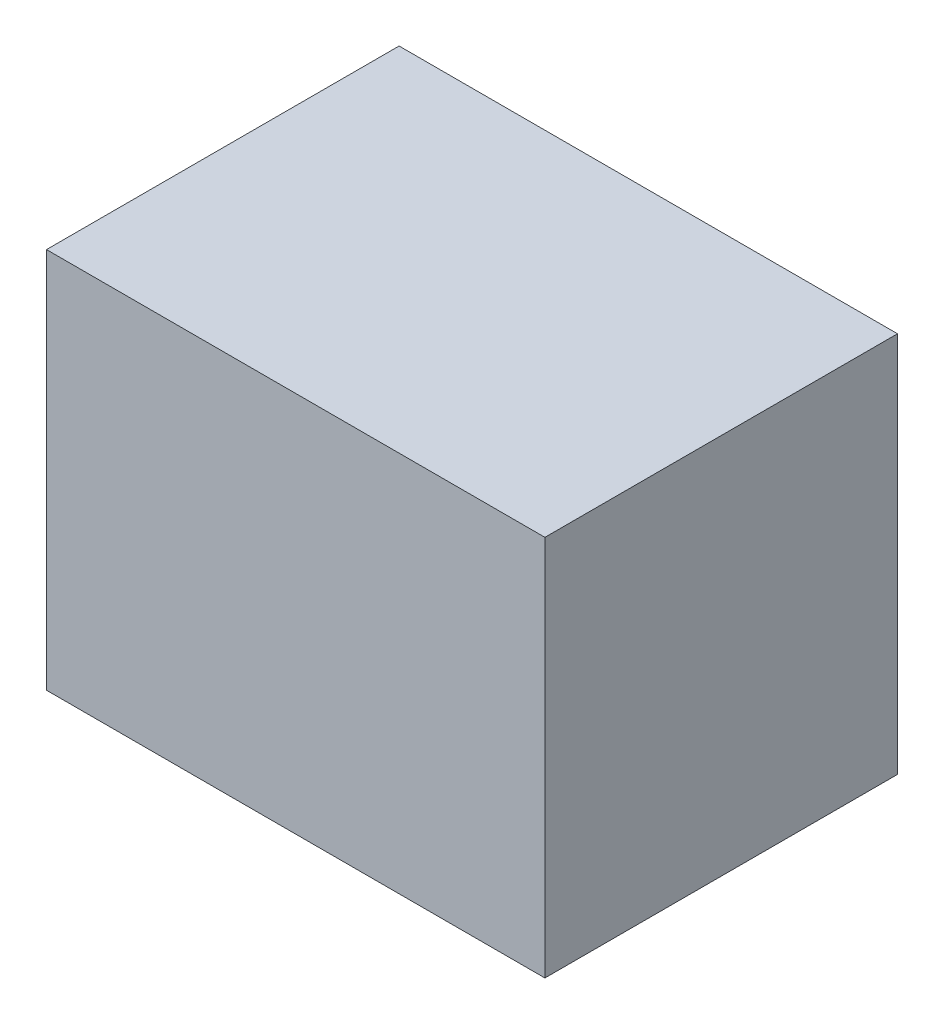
ISO-10303-21;
HEADER;
FILE_DESCRIPTION(('STEP AP214'),'2;1');
FILE_NAME('part.step','',(''),(''),'','','');
FILE_SCHEMA(('AUTOMOTIVE_DESIGN { 1 0 10303 214 1 1 1 1 }'));
ENDSEC;
DATA;
#1=APPLICATION_CONTEXT('core data for automotive mechanical design processes');
#2=APPLICATION_PROTOCOL_DEFINITION('international standard','automotive_design',2000,#1);
#3=PRODUCT_CONTEXT('',#1,'mechanical');
#4=PRODUCT('Part','Part','',(#3));
#5=PRODUCT_RELATED_PRODUCT_CATEGORY('part','',(#4));
#6=PRODUCT_DEFINITION_FORMATION('','',#4);
#7=PRODUCT_DEFINITION_CONTEXT('part definition',#1,'design');
#8=PRODUCT_DEFINITION('design','',#6,#7);
#9=PRODUCT_DEFINITION_SHAPE('','',#8);
#10=(LENGTH_UNIT() NAMED_UNIT(*) SI_UNIT(.MILLI.,.METRE.));
#11=(NAMED_UNIT(*) PLANE_ANGLE_UNIT() SI_UNIT($,.RADIAN.));
#12=(NAMED_UNIT(*) SI_UNIT($,.STERADIAN.) SOLID_ANGLE_UNIT());
#13=UNCERTAINTY_MEASURE_WITH_UNIT(LENGTH_MEASURE(1.E-05),#10,'distance_accuracy_value','');
#14=(GEOMETRIC_REPRESENTATION_CONTEXT(3) GLOBAL_UNCERTAINTY_ASSIGNED_CONTEXT((#13)) GLOBAL_UNIT_ASSIGNED_CONTEXT((#10,
#11,#12)) REPRESENTATION_CONTEXT('',''));
#15=CARTESIAN_POINT('',(0.,0.,0.));
#16=DIRECTION('',(0.,0.,1.));
#17=DIRECTION('',(1.,0.,0.));
#18=AXIS2_PLACEMENT_3D('',#15,#16,#17);
#19=CARTESIAN_POINT('',(83.0943125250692,127.254,-58.7846534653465));
#20=DIRECTION('',(-1.,0.,0.));
#21=DIRECTION('',(0.,0.,1.));
#22=AXIS2_PLACEMENT_3D('',#19,#20,#21);
#23=PLANE('',#22);
#24=DIRECTION('',(0.,0.,-1.));
#25=VECTOR('',#24,1.);
#26=CARTESIAN_POINT('',(83.0943125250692,0.,-58.7846534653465));
#27=LINE('',#26,#25);
#28=CARTESIAN_POINT('',(83.0943125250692,0.,58.7846534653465));
#29=VERTEX_POINT('',#28);
#30=CARTESIAN_POINT('',(83.0943125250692,0.,-58.7846534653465));
#31=VERTEX_POINT('',#30);
#32=EDGE_CURVE('E142',#29,#31,#27,.T.);
#33=ORIENTED_EDGE('',*,*,#32,.T.);
#34=DIRECTION('',(0.,-1.,0.));
#35=VECTOR('',#34,1.);
#36=CARTESIAN_POINT('',(83.0943125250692,127.254,-58.7846534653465));
#37=LINE('',#36,#35);
#38=CARTESIAN_POINT('',(83.0943125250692,127.254,-58.7846534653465));
#39=VERTEX_POINT('',#38);
#40=EDGE_CURVE('E133',#39,#31,#37,.T.);
#41=ORIENTED_EDGE('',*,*,#40,.F.);
#42=DIRECTION('',(0.,0.,-1.));
#43=VECTOR('',#42,1.);
#44=CARTESIAN_POINT('',(83.0943125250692,127.254,-58.7846534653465));
#45=LINE('',#44,#43);
#46=CARTESIAN_POINT('',(83.0943125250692,127.254,58.7846534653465));
#47=VERTEX_POINT('',#46);
#48=EDGE_CURVE('E127',#47,#39,#45,.T.);
#49=ORIENTED_EDGE('',*,*,#48,.F.);
#50=DIRECTION('',(0.,-1.,0.));
#51=VECTOR('',#50,1.);
#52=CARTESIAN_POINT('',(83.0943125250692,127.254,58.7846534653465));
#53=LINE('',#52,#51);
#54=EDGE_CURVE('E138',#47,#29,#53,.T.);
#55=ORIENTED_EDGE('',*,*,#54,.T.);
#56=EDGE_LOOP('',(#33,#41,#49,#55));
#57=FACE_BOUND('',#56,.T.);
#58=ADVANCED_FACE('F36',(#57),#23,.F.);
#59=CARTESIAN_POINT('',(-83.0943125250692,127.254,-58.7846534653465));
#60=DIRECTION('',(0.,0.,1.));
#61=DIRECTION('',(1.,0.,0.));
#62=AXIS2_PLACEMENT_3D('',#59,#60,#61);
#63=PLANE('',#62);
#64=DIRECTION('',(-1.,0.,0.));
#65=VECTOR('',#64,1.);
#66=CARTESIAN_POINT('',(-83.0943125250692,0.,-58.7846534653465));
#67=LINE('',#66,#65);
#68=CARTESIAN_POINT('',(-83.0943125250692,0.,-58.7846534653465));
#69=VERTEX_POINT('',#68);
#70=EDGE_CURVE('E132',#31,#69,#67,.T.);
#71=ORIENTED_EDGE('',*,*,#70,.T.);
#72=DIRECTION('',(0.,-1.,0.));
#73=VECTOR('',#72,1.);
#74=CARTESIAN_POINT('',(-83.0943125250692,127.254,-58.7846534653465));
#75=LINE('',#74,#73);
#76=CARTESIAN_POINT('',(-83.0943125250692,127.254,-58.7846534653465));
#77=VERTEX_POINT('',#76);
#78=EDGE_CURVE('E130',#77,#69,#75,.T.);
#79=ORIENTED_EDGE('',*,*,#78,.F.);
#80=DIRECTION('',(-1.,0.,0.));
#81=VECTOR('',#80,1.);
#82=CARTESIAN_POINT('',(-83.0943125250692,127.254,-58.7846534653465));
#83=LINE('',#82,#81);
#84=EDGE_CURVE('E122',#39,#77,#83,.T.);
#85=ORIENTED_EDGE('',*,*,#84,.F.);
#86=ORIENTED_EDGE('',*,*,#40,.T.);
#87=EDGE_LOOP('',(#71,#79,#85,#86));
#88=FACE_BOUND('',#87,.T.);
#89=ADVANCED_FACE('F131',(#88),#63,.F.);
#90=CARTESIAN_POINT('',(-83.0943125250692,127.254,-58.7846534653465));
#91=DIRECTION('',(1.,0.,0.));
#92=DIRECTION('',(0.,0.,-1.));
#93=AXIS2_PLACEMENT_3D('',#90,#91,#92);
#94=PLANE('',#93);
#95=DIRECTION('',(0.,0.,1.));
#96=VECTOR('',#95,1.);
#97=CARTESIAN_POINT('',(-83.0943125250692,0.,-58.7846534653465));
#98=LINE('',#97,#96);
#99=CARTESIAN_POINT('',(-83.0943125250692,0.,58.7846534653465));
#100=VERTEX_POINT('',#99);
#101=EDGE_CURVE('E108',#69,#100,#98,.T.);
#102=ORIENTED_EDGE('',*,*,#101,.T.);
#103=DIRECTION('',(0.,-1.,0.));
#104=VECTOR('',#103,1.);
#105=CARTESIAN_POINT('',(-83.0943125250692,127.254,58.7846534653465));
#106=LINE('',#105,#104);
#107=CARTESIAN_POINT('',(-83.0943125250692,127.254,58.7846534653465));
#108=VERTEX_POINT('',#107);
#109=EDGE_CURVE('E134',#108,#100,#106,.T.);
#110=ORIENTED_EDGE('',*,*,#109,.F.);
#111=DIRECTION('',(0.,0.,1.));
#112=VECTOR('',#111,1.);
#113=CARTESIAN_POINT('',(-83.0943125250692,127.254,-58.7846534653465));
#114=LINE('',#113,#112);
#115=EDGE_CURVE('E125',#77,#108,#114,.T.);
#116=ORIENTED_EDGE('',*,*,#115,.F.);
#117=ORIENTED_EDGE('',*,*,#78,.T.);
#118=EDGE_LOOP('',(#102,#110,#116,#117));
#119=FACE_BOUND('',#118,.T.);
#120=ADVANCED_FACE('F136',(#119),#94,.F.);
#121=CARTESIAN_POINT('',(-83.0943125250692,127.254,58.7846534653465));
#122=DIRECTION('',(0.,0.,-1.));
#123=DIRECTION('',(-1.,0.,0.));
#124=AXIS2_PLACEMENT_3D('',#121,#122,#123);
#125=PLANE('',#124);
#126=DIRECTION('',(1.,0.,0.));
#127=VECTOR('',#126,1.);
#128=CARTESIAN_POINT('',(-83.0943125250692,0.,58.7846534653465));
#129=LINE('',#128,#127);
#130=EDGE_CURVE('E114',#100,#29,#129,.T.);
#131=ORIENTED_EDGE('',*,*,#130,.T.);
#132=ORIENTED_EDGE('',*,*,#54,.F.);
#133=DIRECTION('',(1.,0.,0.));
#134=VECTOR('',#133,1.);
#135=CARTESIAN_POINT('',(-83.0943125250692,127.254,58.7846534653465));
#136=LINE('',#135,#134);
#137=EDGE_CURVE('E91',#108,#47,#136,.T.);
#138=ORIENTED_EDGE('',*,*,#137,.F.);
#139=ORIENTED_EDGE('',*,*,#109,.T.);
#140=EDGE_LOOP('',(#131,#132,#138,#139));
#141=FACE_BOUND('',#140,.T.);
#142=ADVANCED_FACE('F206',(#141),#125,.F.);
#143=CARTESIAN_POINT('',(83.0943125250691,127.254,58.7846534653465));
#144=DIRECTION('',(0.,1.,0.));
#145=DIRECTION('',(0.,0.,1.));
#146=AXIS2_PLACEMENT_3D('',#143,#144,#145);
#147=PLANE('',#146);
#148=ORIENTED_EDGE('',*,*,#48,.T.);
#149=ORIENTED_EDGE('',*,*,#84,.T.);
#150=ORIENTED_EDGE('',*,*,#115,.T.);
#151=ORIENTED_EDGE('',*,*,#137,.T.);
#152=EDGE_LOOP('',(#148,#149,#150,#151));
#153=FACE_BOUND('',#152,.T.);
#154=ADVANCED_FACE('F123',(#153),#147,.T.);
#155=CARTESIAN_POINT('',(83.0943125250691,0.,58.7846534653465));
#156=DIRECTION('',(0.,1.,0.));
#157=DIRECTION('',(0.,0.,1.));
#158=AXIS2_PLACEMENT_3D('',#155,#156,#157);
#159=PLANE('',#158);
#160=ORIENTED_EDGE('',*,*,#32,.F.);
#161=ORIENTED_EDGE('',*,*,#130,.F.);
#162=ORIENTED_EDGE('',*,*,#101,.F.);
#163=ORIENTED_EDGE('',*,*,#70,.F.);
#164=EDGE_LOOP('',(#160,#161,#162,#163));
#165=FACE_BOUND('',#164,.T.);
#166=ADVANCED_FACE('F209',(#165),#159,.F.);
#167=CLOSED_SHELL('',(#58,#89,#120,#142,#154,#166));
#168=CARTESIAN_POINT('',(80.5543125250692,127.254,-58.7846534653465));
#169=DIRECTION('',(-1.,0.,0.));
#170=DIRECTION('',(0.,0.,1.));
#171=AXIS2_PLACEMENT_3D('',#168,#169,#170);
#172=PLANE('',#171);
#173=DIRECTION('',(0.,0.,-1.));
#174=VECTOR('',#173,1.);
#175=CARTESIAN_POINT('',(80.5543125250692,2.54,-58.7846534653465));
#176=LINE('',#175,#174);
#177=CARTESIAN_POINT('',(80.5543125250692,2.54,56.2446534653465));
#178=VERTEX_POINT('',#177);
#179=CARTESIAN_POINT('',(80.5543125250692,2.54,-56.2446534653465));
#180=VERTEX_POINT('',#179);
#181=EDGE_CURVE('E40',#178,#180,#176,.T.);
#182=ORIENTED_EDGE('',*,*,#181,.F.);
#183=DIRECTION('',(0.,-1.,0.));
#184=VECTOR('',#183,1.);
#185=CARTESIAN_POINT('',(80.5543125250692,127.254,56.2446534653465));
#186=LINE('',#185,#184);
#187=CARTESIAN_POINT('',(80.5543125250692,124.714,56.2446534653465));
#188=VERTEX_POINT('',#187);
#189=EDGE_CURVE('E166',#188,#178,#186,.T.);
#190=ORIENTED_EDGE('',*,*,#189,.F.);
#191=DIRECTION('',(0.,0.,-1.));
#192=VECTOR('',#191,1.);
#193=CARTESIAN_POINT('',(80.5543125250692,124.714,-58.7846534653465));
#194=LINE('',#193,#192);
#195=CARTESIAN_POINT('',(80.5543125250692,124.714,-56.2446534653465));
#196=VERTEX_POINT('',#195);
#197=EDGE_CURVE('E153',#188,#196,#194,.T.);
#198=ORIENTED_EDGE('',*,*,#197,.T.);
#199=DIRECTION('',(0.,-1.,0.));
#200=VECTOR('',#199,1.);
#201=CARTESIAN_POINT('',(80.5543125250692,127.254,-56.2446534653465));
#202=LINE('',#201,#200);
#203=EDGE_CURVE('E164',#196,#180,#202,.T.);
#204=ORIENTED_EDGE('',*,*,#203,.T.);
#205=EDGE_LOOP('',(#182,#190,#198,#204));
#206=FACE_BOUND('',#205,.T.);
#207=ADVANCED_FACE('F173',(#206),#172,.T.);
#208=CARTESIAN_POINT('',(-83.0943125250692,127.254,-56.2446534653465));
#209=DIRECTION('',(0.,0.,1.));
#210=DIRECTION('',(1.,0.,0.));
#211=AXIS2_PLACEMENT_3D('',#208,#209,#210);
#212=PLANE('',#211);
#213=DIRECTION('',(-1.,0.,0.));
#214=VECTOR('',#213,1.);
#215=CARTESIAN_POINT('',(-83.0943125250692,2.54,-56.2446534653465));
#216=LINE('',#215,#214);
#217=CARTESIAN_POINT('',(-80.5543125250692,2.54,-56.2446534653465));
#218=VERTEX_POINT('',#217);
#219=EDGE_CURVE('E56',#180,#218,#216,.T.);
#220=ORIENTED_EDGE('',*,*,#219,.F.);
#221=ORIENTED_EDGE('',*,*,#203,.F.);
#222=DIRECTION('',(-1.,0.,0.));
#223=VECTOR('',#222,1.);
#224=CARTESIAN_POINT('',(-83.0943125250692,124.714,-56.2446534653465));
#225=LINE('',#224,#223);
#226=CARTESIAN_POINT('',(-80.5543125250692,124.714,-56.2446534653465));
#227=VERTEX_POINT('',#226);
#228=EDGE_CURVE('E79',#196,#227,#225,.T.);
#229=ORIENTED_EDGE('',*,*,#228,.T.);
#230=DIRECTION('',(0.,-1.,0.));
#231=VECTOR('',#230,1.);
#232=CARTESIAN_POINT('',(-80.5543125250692,127.254,-56.2446534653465));
#233=LINE('',#232,#231);
#234=EDGE_CURVE('E160',#227,#218,#233,.T.);
#235=ORIENTED_EDGE('',*,*,#234,.T.);
#236=EDGE_LOOP('',(#220,#221,#229,#235));
#237=FACE_BOUND('',#236,.T.);
#238=ADVANCED_FACE('F174',(#237),#212,.T.);
#239=CARTESIAN_POINT('',(-80.5543125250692,127.254,-58.7846534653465));
#240=DIRECTION('',(1.,0.,0.));
#241=DIRECTION('',(0.,0.,-1.));
#242=AXIS2_PLACEMENT_3D('',#239,#240,#241);
#243=PLANE('',#242);
#244=DIRECTION('',(0.,0.,1.));
#245=VECTOR('',#244,1.);
#246=CARTESIAN_POINT('',(-80.5543125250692,2.54,-58.7846534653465));
#247=LINE('',#246,#245);
#248=CARTESIAN_POINT('',(-80.5543125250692,2.54,56.2446534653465));
#249=VERTEX_POINT('',#248);
#250=EDGE_CURVE('E162',#218,#249,#247,.T.);
#251=ORIENTED_EDGE('',*,*,#250,.F.);
#252=ORIENTED_EDGE('',*,*,#234,.F.);
#253=DIRECTION('',(0.,0.,1.));
#254=VECTOR('',#253,1.);
#255=CARTESIAN_POINT('',(-80.5543125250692,124.714,-58.7846534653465));
#256=LINE('',#255,#254);
#257=CARTESIAN_POINT('',(-80.5543125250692,124.714,56.2446534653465));
#258=VERTEX_POINT('',#257);
#259=EDGE_CURVE('E47',#227,#258,#256,.T.);
#260=ORIENTED_EDGE('',*,*,#259,.T.);
#261=DIRECTION('',(0.,-1.,0.));
#262=VECTOR('',#261,1.);
#263=CARTESIAN_POINT('',(-80.5543125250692,127.254,56.2446534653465));
#264=LINE('',#263,#262);
#265=EDGE_CURVE('E155',#258,#249,#264,.T.);
#266=ORIENTED_EDGE('',*,*,#265,.T.);
#267=EDGE_LOOP('',(#251,#252,#260,#266));
#268=FACE_BOUND('',#267,.T.);
#269=ADVANCED_FACE('F178',(#268),#243,.T.);
#270=CARTESIAN_POINT('',(-83.0943125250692,127.254,56.2446534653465));
#271=DIRECTION('',(0.,0.,-1.));
#272=DIRECTION('',(-1.,0.,0.));
#273=AXIS2_PLACEMENT_3D('',#270,#271,#272);
#274=PLANE('',#273);
#275=DIRECTION('',(1.,0.,0.));
#276=VECTOR('',#275,1.);
#277=CARTESIAN_POINT('',(-83.0943125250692,2.54,56.2446534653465));
#278=LINE('',#277,#276);
#279=EDGE_CURVE('E158',#249,#178,#278,.T.);
#280=ORIENTED_EDGE('',*,*,#279,.F.);
#281=ORIENTED_EDGE('',*,*,#265,.F.);
#282=DIRECTION('',(1.,0.,0.));
#283=VECTOR('',#282,1.);
#284=CARTESIAN_POINT('',(-83.0943125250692,124.714,56.2446534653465));
#285=LINE('',#284,#283);
#286=EDGE_CURVE('E11',#258,#188,#285,.T.);
#287=ORIENTED_EDGE('',*,*,#286,.T.);
#288=ORIENTED_EDGE('',*,*,#189,.T.);
#289=EDGE_LOOP('',(#280,#281,#287,#288));
#290=FACE_BOUND('',#289,.T.);
#291=ADVANCED_FACE('F182',(#290),#274,.T.);
#292=CARTESIAN_POINT('',(83.0943125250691,124.714,58.7846534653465));
#293=DIRECTION('',(0.,1.,0.));
#294=DIRECTION('',(0.,0.,1.));
#295=AXIS2_PLACEMENT_3D('',#292,#293,#294);
#296=PLANE('',#295);
#297=ORIENTED_EDGE('',*,*,#197,.F.);
#298=ORIENTED_EDGE('',*,*,#286,.F.);
#299=ORIENTED_EDGE('',*,*,#259,.F.);
#300=ORIENTED_EDGE('',*,*,#228,.F.);
#301=EDGE_LOOP('',(#297,#298,#299,#300));
#302=FACE_BOUND('',#301,.T.);
#303=ADVANCED_FACE('F181',(#302),#296,.F.);
#304=CARTESIAN_POINT('',(83.0943125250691,2.54,58.7846534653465));
#305=DIRECTION('',(0.,1.,0.));
#306=DIRECTION('',(0.,0.,1.));
#307=AXIS2_PLACEMENT_3D('',#304,#305,#306);
#308=PLANE('',#307);
#309=ORIENTED_EDGE('',*,*,#181,.T.);
#310=ORIENTED_EDGE('',*,*,#219,.T.);
#311=ORIENTED_EDGE('',*,*,#250,.T.);
#312=ORIENTED_EDGE('',*,*,#279,.T.);
#313=EDGE_LOOP('',(#309,#310,#311,#312));
#314=FACE_BOUND('',#313,.T.);
#315=ADVANCED_FACE('F38',(#314),#308,.T.);
#316=CLOSED_SHELL('',(#207,#238,#269,#291,#303,#315));
#317=ORIENTED_CLOSED_SHELL('',*,#316,.T.);
#318=BREP_WITH_VOIDS('B2',#167,(#317));
#319=ADVANCED_BREP_SHAPE_REPRESENTATION('',(#18,#318),#14);
#320=SHAPE_DEFINITION_REPRESENTATION(#9,#319);
ENDSEC;
END-ISO-10303-21;
